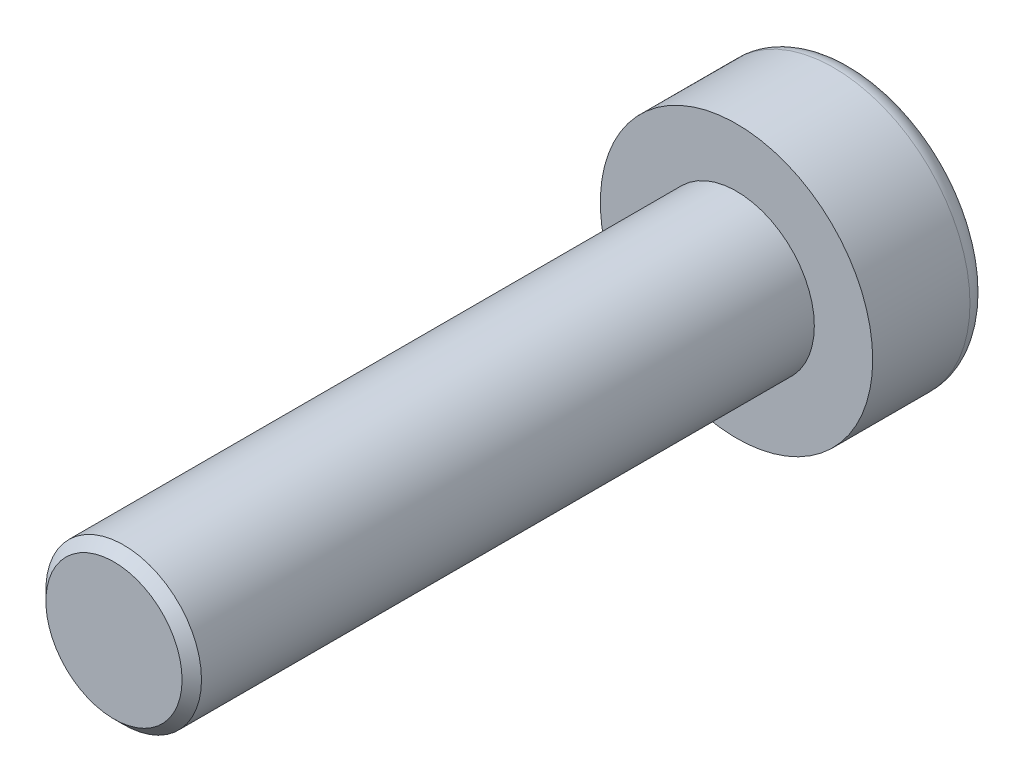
ISO-10303-21;
HEADER;
FILE_DESCRIPTION(('STEP AP214'),'2;1');
FILE_NAME('part.step','',(''),(''),'','','');
FILE_SCHEMA(('AUTOMOTIVE_DESIGN { 1 0 10303 214 1 1 1 1 }'));
ENDSEC;
DATA;
#1=APPLICATION_CONTEXT('core data for automotive mechanical design processes');
#2=APPLICATION_PROTOCOL_DEFINITION('international standard','automotive_design',2000,#1);
#3=PRODUCT_CONTEXT('',#1,'mechanical');
#4=PRODUCT('Part','Part','',(#3));
#5=PRODUCT_RELATED_PRODUCT_CATEGORY('part','',(#4));
#6=PRODUCT_DEFINITION_FORMATION('','',#4);
#7=PRODUCT_DEFINITION_CONTEXT('part definition',#1,'design');
#8=PRODUCT_DEFINITION('design','',#6,#7);
#9=PRODUCT_DEFINITION_SHAPE('','',#8);
#10=(LENGTH_UNIT() NAMED_UNIT(*) SI_UNIT(.MILLI.,.METRE.));
#11=(NAMED_UNIT(*) PLANE_ANGLE_UNIT() SI_UNIT($,.RADIAN.));
#12=(NAMED_UNIT(*) SI_UNIT($,.STERADIAN.) SOLID_ANGLE_UNIT());
#13=UNCERTAINTY_MEASURE_WITH_UNIT(LENGTH_MEASURE(1.E-05),#10,'distance_accuracy_value','');
#14=(GEOMETRIC_REPRESENTATION_CONTEXT(3) GLOBAL_UNCERTAINTY_ASSIGNED_CONTEXT((#13)) GLOBAL_UNIT_ASSIGNED_CONTEXT((#10,
#11,#12)) REPRESENTATION_CONTEXT('',''));
#15=CARTESIAN_POINT('',(0.,0.,0.));
#16=DIRECTION('',(0.,0.,1.));
#17=DIRECTION('',(1.,0.,0.));
#18=AXIS2_PLACEMENT_3D('',#15,#16,#17);
#19=CARTESIAN_POINT('',(0.,0.,3.));
#20=DIRECTION('',(0.,0.,-1.));
#21=DIRECTION('',(-1.,0.,0.));
#22=AXIS2_PLACEMENT_3D('',#19,#20,#21);
#23=CYLINDRICAL_SURFACE('',#22,3.5);
#24=CARTESIAN_POINT('',(0.,0.,0.5));
#25=DIRECTION('',(0.,0.,1.));
#26=DIRECTION('',(1.,0.,0.));
#27=AXIS2_PLACEMENT_3D('',#24,#25,#26);
#28=CIRCLE('',#27,3.5);
#29=CARTESIAN_POINT('',(3.5,0.,0.500000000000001));
#30=VERTEX_POINT('',#29);
#31=EDGE_CURVE('E37',#30,#30,#28,.T.);
#32=ORIENTED_EDGE('',*,*,#31,.T.);
#33=EDGE_LOOP('',(#32));
#34=FACE_BOUND('',#33,.T.);
#35=CARTESIAN_POINT('',(0.,0.,3.));
#36=DIRECTION('',(0.,0.,1.));
#37=DIRECTION('',(1.,0.,0.));
#38=AXIS2_PLACEMENT_3D('',#35,#36,#37);
#39=CIRCLE('',#38,3.5);
#40=CARTESIAN_POINT('',(3.5,0.,3.));
#41=VERTEX_POINT('',#40);
#42=EDGE_CURVE('E51',#41,#41,#39,.T.);
#43=ORIENTED_EDGE('',*,*,#42,.F.);
#44=EDGE_LOOP('',(#43));
#45=FACE_BOUND('',#44,.T.);
#46=ADVANCED_FACE('F31',(#34,#45),#23,.T.);
#47=CARTESIAN_POINT('',(0.,0.,3.));
#48=DIRECTION('',(0.,0.,1.));
#49=DIRECTION('',(1.,0.,0.));
#50=AXIS2_PLACEMENT_3D('',#47,#48,#49);
#51=PLANE('',#50);
#52=CARTESIAN_POINT('',(0.,0.,3.));
#53=DIRECTION('',(0.,0.,1.));
#54=DIRECTION('',(1.,0.,0.));
#55=AXIS2_PLACEMENT_3D('',#52,#53,#54);
#56=CIRCLE('',#55,2.);
#57=CARTESIAN_POINT('',(2.,0.,3.));
#58=VERTEX_POINT('',#57);
#59=EDGE_CURVE('E50',#58,#58,#56,.T.);
#60=ORIENTED_EDGE('',*,*,#59,.F.);
#61=EDGE_LOOP('',(#60));
#62=FACE_BOUND('',#61,.T.);
#63=ORIENTED_EDGE('',*,*,#42,.T.);
#64=EDGE_LOOP('',(#63));
#65=FACE_BOUND('',#64,.T.);
#66=ADVANCED_FACE('F59',(#62,#65),#51,.T.);
#67=CARTESIAN_POINT('',(0.,0.,0.));
#68=DIRECTION('',(0.,0.,1.));
#69=DIRECTION('',(1.,0.,0.));
#70=AXIS2_PLACEMENT_3D('',#67,#68,#69);
#71=PLANE('',#70);
#72=CARTESIAN_POINT('',(0.,0.,0.));
#73=DIRECTION('',(0.,0.,1.));
#74=DIRECTION('',(1.,0.,0.));
#75=AXIS2_PLACEMENT_3D('',#72,#73,#74);
#76=CIRCLE('',#75,3.);
#77=CARTESIAN_POINT('',(3.,0.,0.));
#78=VERTEX_POINT('',#77);
#79=EDGE_CURVE('E10',#78,#78,#76,.F.);
#80=ORIENTED_EDGE('',*,*,#79,.T.);
#81=EDGE_LOOP('',(#80));
#82=FACE_BOUND('',#81,.T.);
#83=ADVANCED_FACE('F62',(#82),#71,.F.);
#84=CARTESIAN_POINT('',(0.,0.,19.));
#85=DIRECTION('',(0.,0.,-1.));
#86=DIRECTION('',(-1.,0.,0.));
#87=AXIS2_PLACEMENT_3D('',#84,#85,#86);
#88=CYLINDRICAL_SURFACE('',#87,2.);
#89=CARTESIAN_POINT('',(0.,0.,18.75));
#90=DIRECTION('',(0.,0.,1.));
#91=DIRECTION('',(1.,0.,0.));
#92=AXIS2_PLACEMENT_3D('',#89,#90,#91);
#93=CIRCLE('',#92,2.);
#94=CARTESIAN_POINT('',(2.,0.,18.75));
#95=VERTEX_POINT('',#94);
#96=EDGE_CURVE('E41',#95,#95,#93,.F.);
#97=ORIENTED_EDGE('',*,*,#96,.T.);
#98=EDGE_LOOP('',(#97));
#99=FACE_BOUND('',#98,.T.);
#100=ORIENTED_EDGE('',*,*,#59,.T.);
#101=EDGE_LOOP('',(#100));
#102=FACE_BOUND('',#101,.T.);
#103=ADVANCED_FACE('F57',(#99,#102),#88,.T.);
#104=CARTESIAN_POINT('',(0.,0.,19.));
#105=DIRECTION('',(0.,0.,1.));
#106=DIRECTION('',(1.,0.,0.));
#107=AXIS2_PLACEMENT_3D('',#104,#105,#106);
#108=PLANE('',#107);
#109=CARTESIAN_POINT('',(0.,0.,19.));
#110=DIRECTION('',(0.,0.,1.));
#111=DIRECTION('',(1.,0.,0.));
#112=AXIS2_PLACEMENT_3D('',#109,#110,#111);
#113=CIRCLE('',#112,1.75);
#114=CARTESIAN_POINT('',(1.75,0.,19.));
#115=VERTEX_POINT('',#114);
#116=EDGE_CURVE('E45',#115,#115,#113,.T.);
#117=ORIENTED_EDGE('',*,*,#116,.T.);
#118=EDGE_LOOP('',(#117));
#119=FACE_BOUND('',#118,.T.);
#120=ADVANCED_FACE('F84',(#119),#108,.T.);
#121=CARTESIAN_POINT('',(0.,0.,19.));
#122=DIRECTION('',(0.,0.,-1.));
#123=DIRECTION('',(-1.,0.,0.));
#124=AXIS2_PLACEMENT_3D('',#121,#122,#123);
#125=CONICAL_SURFACE('',#124,1.75,0.785398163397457);
#126=ORIENTED_EDGE('',*,*,#96,.F.);
#127=EDGE_LOOP('',(#126));
#128=FACE_BOUND('',#127,.T.);
#129=ORIENTED_EDGE('',*,*,#116,.F.);
#130=EDGE_LOOP('',(#129));
#131=FACE_BOUND('',#130,.T.);
#132=ADVANCED_FACE('F92',(#128,#131),#125,.T.);
#133=CARTESIAN_POINT('',(0.,0.,0.5));
#134=DIRECTION('',(0.,0.,1.));
#135=DIRECTION('',(1.,0.,0.));
#136=AXIS2_PLACEMENT_3D('',#133,#134,#135);
#137=TOROIDAL_SURFACE('',#136,3.,0.5);
#138=ORIENTED_EDGE('',*,*,#79,.F.);
#139=EDGE_LOOP('',(#138));
#140=FACE_BOUND('',#139,.T.);
#141=ORIENTED_EDGE('',*,*,#31,.F.);
#142=EDGE_LOOP('',(#141));
#143=FACE_BOUND('',#142,.T.);
#144=ADVANCED_FACE('F100',(#140,#143),#137,.T.);
#145=CLOSED_SHELL('',(#46,#66,#83,#103,#120,#132,#144));
#146=MANIFOLD_SOLID_BREP('B2',#145);
#147=ADVANCED_BREP_SHAPE_REPRESENTATION('',(#18,#146),#14);
#148=SHAPE_DEFINITION_REPRESENTATION(#9,#147);
ENDSEC;
END-ISO-10303-21;
